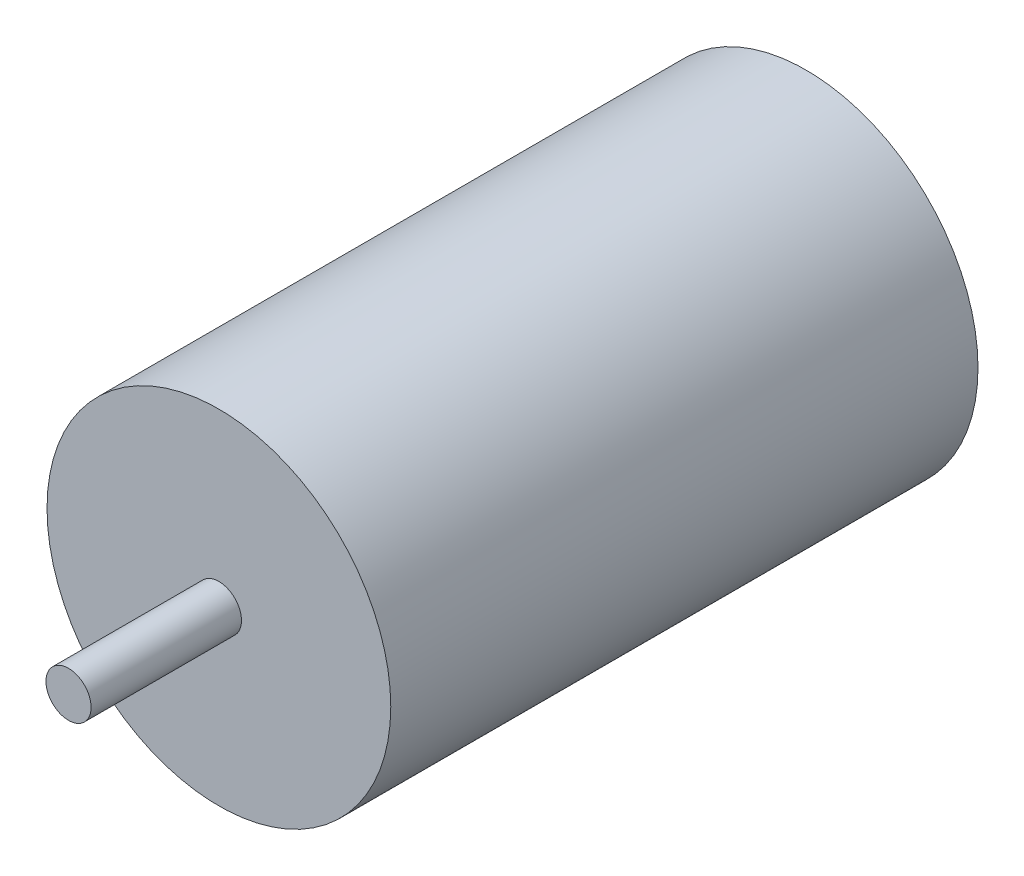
ISO-10303-21;
HEADER;
FILE_DESCRIPTION(('STEP AP214'),'2;1');
FILE_NAME('part.step','',(''),(''),'','','');
FILE_SCHEMA(('AUTOMOTIVE_DESIGN { 1 0 10303 214 1 1 1 1 }'));
ENDSEC;
DATA;
#1=APPLICATION_CONTEXT('core data for automotive mechanical design processes');
#2=APPLICATION_PROTOCOL_DEFINITION('international standard','automotive_design',2000,#1);
#3=PRODUCT_CONTEXT('',#1,'mechanical');
#4=PRODUCT('Part','Part','',(#3));
#5=PRODUCT_RELATED_PRODUCT_CATEGORY('part','',(#4));
#6=PRODUCT_DEFINITION_FORMATION('','',#4);
#7=PRODUCT_DEFINITION_CONTEXT('part definition',#1,'design');
#8=PRODUCT_DEFINITION('design','',#6,#7);
#9=PRODUCT_DEFINITION_SHAPE('','',#8);
#10=(LENGTH_UNIT() NAMED_UNIT(*) SI_UNIT(.MILLI.,.METRE.));
#11=(NAMED_UNIT(*) PLANE_ANGLE_UNIT() SI_UNIT($,.RADIAN.));
#12=(NAMED_UNIT(*) SI_UNIT($,.STERADIAN.) SOLID_ANGLE_UNIT());
#13=UNCERTAINTY_MEASURE_WITH_UNIT(LENGTH_MEASURE(1.E-05),#10,'distance_accuracy_value','');
#14=(GEOMETRIC_REPRESENTATION_CONTEXT(3) GLOBAL_UNCERTAINTY_ASSIGNED_CONTEXT((#13)) GLOBAL_UNIT_ASSIGNED_CONTEXT((#10,
#11,#12)) REPRESENTATION_CONTEXT('',''));
#15=CARTESIAN_POINT('',(0.,0.,0.));
#16=DIRECTION('',(0.,0.,1.));
#17=DIRECTION('',(1.,0.,0.));
#18=AXIS2_PLACEMENT_3D('',#15,#16,#17);
#19=CARTESIAN_POINT('',(0.,0.,104.14));
#20=DIRECTION('',(0.,0.,-1.));
#21=DIRECTION('',(-1.,0.,0.));
#22=AXIS2_PLACEMENT_3D('',#19,#20,#21);
#23=CYLINDRICAL_SURFACE('',#22,30.48);
#24=CARTESIAN_POINT('',(0.,0.,104.14));
#25=DIRECTION('',(0.,0.,1.));
#26=DIRECTION('',(1.,0.,0.));
#27=AXIS2_PLACEMENT_3D('',#24,#25,#26);
#28=CIRCLE('',#27,30.48);
#29=CARTESIAN_POINT('',(30.48,0.,104.14));
#30=VERTEX_POINT('',#29);
#31=EDGE_CURVE('E10',#30,#30,#28,.T.);
#32=ORIENTED_EDGE('',*,*,#31,.F.);
#33=EDGE_LOOP('',(#32));
#34=FACE_BOUND('',#33,.T.);
#35=CARTESIAN_POINT('',(0.,0.,0.));
#36=DIRECTION('',(0.,0.,1.));
#37=DIRECTION('',(1.,0.,0.));
#38=AXIS2_PLACEMENT_3D('',#35,#36,#37);
#39=CIRCLE('',#38,30.48);
#40=CARTESIAN_POINT('',(30.48,0.,0.));
#41=VERTEX_POINT('',#40);
#42=EDGE_CURVE('E44',#41,#41,#39,.T.);
#43=ORIENTED_EDGE('',*,*,#42,.T.);
#44=EDGE_LOOP('',(#43));
#45=FACE_BOUND('',#44,.T.);
#46=ADVANCED_FACE('F41',(#34,#45),#23,.T.);
#47=CARTESIAN_POINT('',(0.,0.,104.14));
#48=DIRECTION('',(0.,0.,1.));
#49=DIRECTION('',(1.,0.,0.));
#50=AXIS2_PLACEMENT_3D('',#47,#48,#49);
#51=PLANE('',#50);
#52=CARTESIAN_POINT('',(0.,0.,104.14));
#53=DIRECTION('',(0.,0.,1.));
#54=DIRECTION('',(1.,0.,0.));
#55=AXIS2_PLACEMENT_3D('',#52,#53,#54);
#56=CIRCLE('',#55,4.0005);
#57=CARTESIAN_POINT('',(4.0005,0.,104.14));
#58=VERTEX_POINT('',#57);
#59=EDGE_CURVE('E55',#58,#58,#56,.T.);
#60=ORIENTED_EDGE('',*,*,#59,.F.);
#61=EDGE_LOOP('',(#60));
#62=FACE_BOUND('',#61,.T.);
#63=ORIENTED_EDGE('',*,*,#31,.T.);
#64=EDGE_LOOP('',(#63));
#65=FACE_BOUND('',#64,.T.);
#66=ADVANCED_FACE('F72',(#62,#65),#51,.T.);
#67=CARTESIAN_POINT('',(0.,0.,0.));
#68=DIRECTION('',(0.,0.,1.));
#69=DIRECTION('',(1.,0.,0.));
#70=AXIS2_PLACEMENT_3D('',#67,#68,#69);
#71=PLANE('',#70);
#72=ORIENTED_EDGE('',*,*,#42,.F.);
#73=EDGE_LOOP('',(#72));
#74=FACE_BOUND('',#73,.T.);
#75=ADVANCED_FACE('F68',(#74),#71,.F.);
#76=CARTESIAN_POINT('',(0.,0.,130.81));
#77=DIRECTION('',(0.,0.,-1.));
#78=DIRECTION('',(-1.,0.,0.));
#79=AXIS2_PLACEMENT_3D('',#76,#77,#78);
#80=CYLINDRICAL_SURFACE('',#79,4.0005);
#81=CARTESIAN_POINT('',(0.,0.,130.81));
#82=DIRECTION('',(0.,0.,1.));
#83=DIRECTION('',(1.,0.,0.));
#84=AXIS2_PLACEMENT_3D('',#81,#82,#83);
#85=CIRCLE('',#84,4.0005);
#86=CARTESIAN_POINT('',(4.0005,0.,130.81));
#87=VERTEX_POINT('',#86);
#88=EDGE_CURVE('E53',#87,#87,#85,.T.);
#89=ORIENTED_EDGE('',*,*,#88,.F.);
#90=EDGE_LOOP('',(#89));
#91=FACE_BOUND('',#90,.T.);
#92=ORIENTED_EDGE('',*,*,#59,.T.);
#93=EDGE_LOOP('',(#92));
#94=FACE_BOUND('',#93,.T.);
#95=ADVANCED_FACE('F65',(#91,#94),#80,.T.);
#96=CARTESIAN_POINT('',(0.,0.,130.81));
#97=DIRECTION('',(0.,0.,1.));
#98=DIRECTION('',(1.,0.,0.));
#99=AXIS2_PLACEMENT_3D('',#96,#97,#98);
#100=PLANE('',#99);
#101=ORIENTED_EDGE('',*,*,#88,.T.);
#102=EDGE_LOOP('',(#101));
#103=FACE_BOUND('',#102,.T.);
#104=ADVANCED_FACE('F63',(#103),#100,.T.);
#105=CLOSED_SHELL('',(#46,#66,#75,#95,#104));
#106=MANIFOLD_SOLID_BREP('B2',#105);
#107=ADVANCED_BREP_SHAPE_REPRESENTATION('',(#18,#106),#14);
#108=SHAPE_DEFINITION_REPRESENTATION(#9,#107);
ENDSEC;
END-ISO-10303-21;
